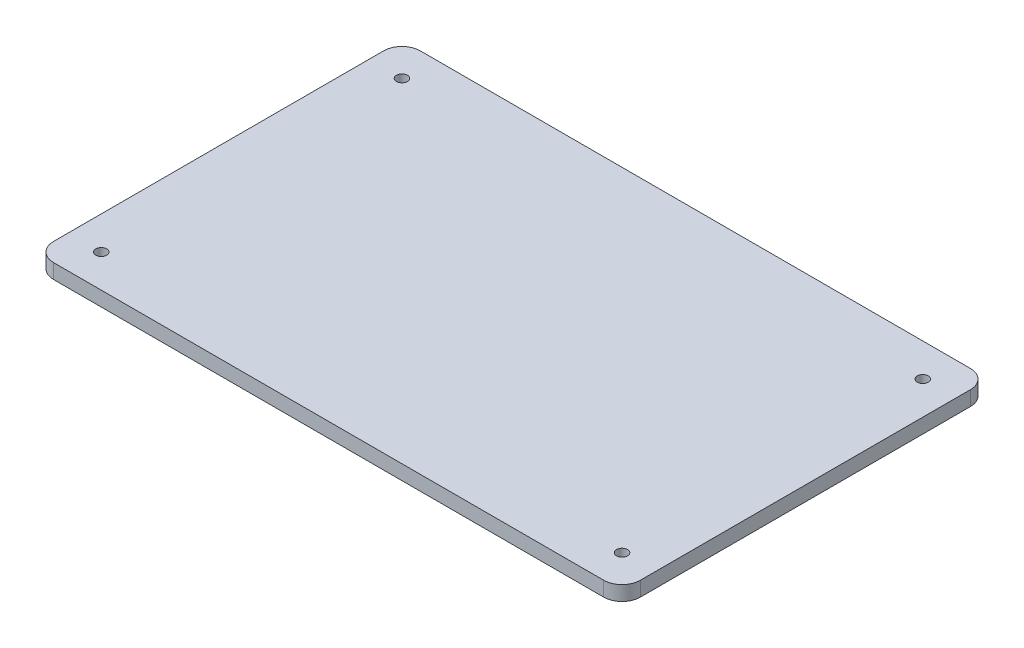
from build123d import *

# Parameters (mm, degrees)
SKIZZE2_W                       = 160
SKIZZE2_H                       = 100
AUFSATZ_LINEAR_AUSTRAGEN1_DEPTH = 4
SKIZZE3_R                       = 1.5
SCHNITT_LINEAR_AUSTRAGEN1_DEPTH = 189.722017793
VERRUNDUNG1_R                   = 5
VERRUNDUNG3_R                   = 5
VERRUNDUNG4_R                   = 5
VERRUNDUNG6_R                   = 5


with BuildPart() as part:
    # Skizze2 → Aufsatz-Linear austragen1 (new body)
    with BuildSketch(Plane(origin=(0, 0, 0), x_dir=(1, 0, 0), z_dir=(0, 1, 0))):
        with Locations((80, -50)):
            Rectangle(SKIZZE2_W, SKIZZE2_H)
    extrude(amount=AUFSATZ_LINEAR_AUSTRAGEN1_DEPTH)

    # Skizze3 → Schnitt-Linear austragen1 (cut, through all)
    with BuildSketch(Plane(origin=(0, 4, 0), x_dir=(1, 0, 0), z_dir=(0, 1, 0))):
        with Locations(Location((9, -91, 0), (0, 0, 270))):
            Circle(SKIZZE3_R)
        with Locations(Location((9, -9, 0), (0, 0, 90))):
            Circle(SKIZZE3_R)
        with Locations(Location((151, -91, 0), (0, 0, 90))):
            Circle(SKIZZE3_R)
        with Locations(Location((151, -9, 0), (0, 0, 270))):
            Circle(SKIZZE3_R)
    extrude(amount=-SCHNITT_LINEAR_AUSTRAGEN1_DEPTH, mode=Mode.SUBTRACT)

    # Verrundung1
    verrundung1_edges = [part.edges().sort_by_distance(p)[0] for p in [
        (0, 2, 100),
    ]]
    fillet(verrundung1_edges, radius=VERRUNDUNG1_R)

    # Verrundung3
    verrundung3_edges = [part.edges().sort_by_distance(p)[0] for p in [
        (160, 2, 0),
    ]]
    fillet(verrundung3_edges, radius=VERRUNDUNG3_R)

    # Verrundung4
    verrundung4_edges = [part.edges().sort_by_distance(p)[0] for p in [
        (0, 2, 0),
    ]]
    fillet(verrundung4_edges, radius=VERRUNDUNG4_R)

    # Verrundung6
    verrundung6_edges = [part.edges().sort_by_distance(p)[0] for p in [
        (160, 2, 100),
    ]]
    fillet(verrundung6_edges, radius=VERRUNDUNG6_R)


solid = part.part
